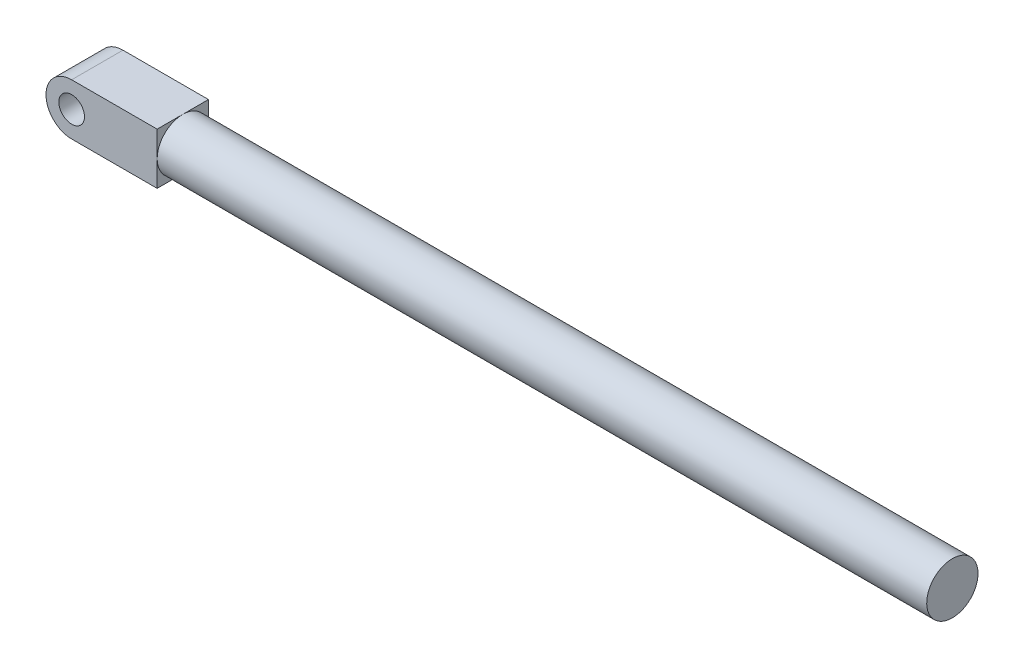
ISO-10303-21;
HEADER;
FILE_DESCRIPTION(('STEP AP214'),'2;1');
FILE_NAME('part.step','',(''),(''),'','','');
FILE_SCHEMA(('AUTOMOTIVE_DESIGN { 1 0 10303 214 1 1 1 1 }'));
ENDSEC;
DATA;
#1=APPLICATION_CONTEXT('core data for automotive mechanical design processes');
#2=APPLICATION_PROTOCOL_DEFINITION('international standard','automotive_design',2000,#1);
#3=PRODUCT_CONTEXT('',#1,'mechanical');
#4=PRODUCT('Part','Part','',(#3));
#5=PRODUCT_RELATED_PRODUCT_CATEGORY('part','',(#4));
#6=PRODUCT_DEFINITION_FORMATION('','',#4);
#7=PRODUCT_DEFINITION_CONTEXT('part definition',#1,'design');
#8=PRODUCT_DEFINITION('design','',#6,#7);
#9=PRODUCT_DEFINITION_SHAPE('','',#8);
#10=(LENGTH_UNIT() NAMED_UNIT(*) SI_UNIT(.MILLI.,.METRE.));
#11=(NAMED_UNIT(*) PLANE_ANGLE_UNIT() SI_UNIT($,.RADIAN.));
#12=(NAMED_UNIT(*) SI_UNIT($,.STERADIAN.) SOLID_ANGLE_UNIT());
#13=UNCERTAINTY_MEASURE_WITH_UNIT(LENGTH_MEASURE(1.E-05),#10,'distance_accuracy_value','');
#14=(GEOMETRIC_REPRESENTATION_CONTEXT(3) GLOBAL_UNCERTAINTY_ASSIGNED_CONTEXT((#13)) GLOBAL_UNIT_ASSIGNED_CONTEXT((#10,
#11,#12)) REPRESENTATION_CONTEXT('',''));
#15=CARTESIAN_POINT('',(0.,0.,0.));
#16=DIRECTION('',(0.,0.,1.));
#17=DIRECTION('',(1.,0.,0.));
#18=AXIS2_PLACEMENT_3D('',#15,#16,#17);
#19=CARTESIAN_POINT('',(5.00000000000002,1.5,3.));
#20=DIRECTION('',(-1.,0.,0.));
#21=DIRECTION('',(0.,-1.,0.));
#22=AXIS2_PLACEMENT_3D('',#19,#20,#21);
#23=PLANE('',#22);
#24=CARTESIAN_POINT('',(5.00000000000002,0.,1.5));
#25=DIRECTION('',(1.,0.,0.));
#26=DIRECTION('',(0.,1.,0.));
#27=AXIS2_PLACEMENT_3D('',#24,#25,#26);
#28=CIRCLE('',#27,1.5);
#29=CARTESIAN_POINT('',(5.00000000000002,1.50000000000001,1.5));
#30=VERTEX_POINT('',#29);
#31=CARTESIAN_POINT('',(5.00000000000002,0.,3.));
#32=VERTEX_POINT('',#31);
#33=EDGE_CURVE('E42',#30,#32,#28,.T.);
#34=ORIENTED_EDGE('',*,*,#33,.F.);
#35=DIRECTION('',(0.,0.,-1.));
#36=VECTOR('',#35,1.);
#37=CARTESIAN_POINT('',(5.00000000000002,1.5,3.));
#38=LINE('',#37,#36);
#39=CARTESIAN_POINT('',(5.00000000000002,1.5,3.));
#40=VERTEX_POINT('',#39);
#41=EDGE_CURVE('E87',#40,#30,#38,.T.);
#42=ORIENTED_EDGE('',*,*,#41,.F.);
#43=DIRECTION('',(0.,1.,0.));
#44=VECTOR('',#43,1.);
#45=CARTESIAN_POINT('',(5.00000000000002,1.5,3.));
#46=LINE('',#45,#44);
#47=EDGE_CURVE('E107',#32,#40,#46,.T.);
#48=ORIENTED_EDGE('',*,*,#47,.F.);
#49=EDGE_LOOP('',(#34,#42,#48));
#50=FACE_BOUND('',#49,.T.);
#51=ADVANCED_FACE('F31',(#50),#23,.F.);
#52=CARTESIAN_POINT('',(5.00000000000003,-1.5,1.5));
#53=VERTEX_POINT('',#52);
#54=EDGE_CURVE('E11',#32,#53,#28,.T.);
#55=ORIENTED_EDGE('',*,*,#54,.F.);
#56=CARTESIAN_POINT('',(5.00000000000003,-1.5,3.));
#57=VERTEX_POINT('',#56);
#58=EDGE_CURVE('E138',#57,#32,#46,.T.);
#59=ORIENTED_EDGE('',*,*,#58,.F.);
#60=DIRECTION('',(0.,0.,-1.));
#61=VECTOR('',#60,1.);
#62=CARTESIAN_POINT('',(5.00000000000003,-1.5,3.));
#63=LINE('',#62,#61);
#64=EDGE_CURVE('E113',#57,#53,#63,.T.);
#65=ORIENTED_EDGE('',*,*,#64,.T.);
#66=EDGE_LOOP('',(#55,#59,#65));
#67=FACE_BOUND('',#66,.T.);
#68=ADVANCED_FACE('F157',(#67),#23,.F.);
#69=CARTESIAN_POINT('',(5.00000000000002,0.,0.));
#70=VERTEX_POINT('',#69);
#71=EDGE_CURVE('E40',#53,#70,#28,.T.);
#72=ORIENTED_EDGE('',*,*,#71,.F.);
#73=CARTESIAN_POINT('',(5.00000000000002,-1.5,0.));
#74=VERTEX_POINT('',#73);
#75=EDGE_CURVE('E96',#53,#74,#63,.T.);
#76=ORIENTED_EDGE('',*,*,#75,.T.);
#77=DIRECTION('',(0.,1.,0.));
#78=VECTOR('',#77,1.);
#79=CARTESIAN_POINT('',(5.00000000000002,1.5,0.));
#80=LINE('',#79,#78);
#81=EDGE_CURVE('E129',#74,#70,#80,.T.);
#82=ORIENTED_EDGE('',*,*,#81,.T.);
#83=EDGE_LOOP('',(#72,#76,#82));
#84=FACE_BOUND('',#83,.T.);
#85=ADVANCED_FACE('F143',(#84),#23,.F.);
#86=EDGE_CURVE('E101',#70,#30,#28,.T.);
#87=ORIENTED_EDGE('',*,*,#86,.F.);
#88=CARTESIAN_POINT('',(5.00000000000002,1.5,0.));
#89=VERTEX_POINT('',#88);
#90=EDGE_CURVE('E103',#70,#89,#80,.T.);
#91=ORIENTED_EDGE('',*,*,#90,.T.);
#92=EDGE_CURVE('E90',#30,#89,#38,.T.);
#93=ORIENTED_EDGE('',*,*,#92,.F.);
#94=EDGE_LOOP('',(#87,#91,#93));
#95=FACE_BOUND('',#94,.T.);
#96=ADVANCED_FACE('F99',(#95),#23,.F.);
#97=CARTESIAN_POINT('',(0.,0.,3.));
#98=DIRECTION('',(0.,0.,1.));
#99=DIRECTION('',(1.,0.,0.));
#100=AXIS2_PLACEMENT_3D('',#97,#98,#99);
#101=PLANE('',#100);
#102=CARTESIAN_POINT('',(0.,0.,3.));
#103=DIRECTION('',(0.,0.,1.));
#104=DIRECTION('',(1.,0.,0.));
#105=AXIS2_PLACEMENT_3D('',#102,#103,#104);
#106=CIRCLE('',#105,1.5);
#107=CARTESIAN_POINT('',(0.,1.5,3.));
#108=VERTEX_POINT('',#107);
#109=CARTESIAN_POINT('',(0.,-1.5,3.));
#110=VERTEX_POINT('',#109);
#111=EDGE_CURVE('E133',#108,#110,#106,.T.);
#112=ORIENTED_EDGE('',*,*,#111,.T.);
#113=DIRECTION('',(1.,0.,0.));
#114=VECTOR('',#113,1.);
#115=CARTESIAN_POINT('',(0.,-1.5,3.));
#116=LINE('',#115,#114);
#117=EDGE_CURVE('E136',#110,#57,#116,.T.);
#118=ORIENTED_EDGE('',*,*,#117,.T.);
#119=ORIENTED_EDGE('',*,*,#58,.T.);
#120=ORIENTED_EDGE('',*,*,#47,.T.);
#121=DIRECTION('',(-1.,0.,0.));
#122=VECTOR('',#121,1.);
#123=CARTESIAN_POINT('',(0.,1.5,3.));
#124=LINE('',#123,#122);
#125=EDGE_CURVE('E93',#40,#108,#124,.T.);
#126=ORIENTED_EDGE('',*,*,#125,.T.);
#127=EDGE_LOOP('',(#112,#118,#119,#120,#126));
#128=FACE_BOUND('',#127,.T.);
#129=CARTESIAN_POINT('',(0.,0.,3.));
#130=DIRECTION('',(0.,0.,1.));
#131=DIRECTION('',(1.,0.,0.));
#132=AXIS2_PLACEMENT_3D('',#129,#130,#131);
#133=CIRCLE('',#132,0.75);
#134=CARTESIAN_POINT('',(0.75,0.,3.));
#135=VERTEX_POINT('',#134);
#136=EDGE_CURVE('E120',#135,#135,#133,.T.);
#137=ORIENTED_EDGE('',*,*,#136,.F.);
#138=EDGE_LOOP('',(#137));
#139=FACE_BOUND('',#138,.T.);
#140=ADVANCED_FACE('F155',(#128,#139),#101,.T.);
#141=CARTESIAN_POINT('',(0.,0.,0.));
#142=DIRECTION('',(0.,0.,1.));
#143=DIRECTION('',(1.,0.,0.));
#144=AXIS2_PLACEMENT_3D('',#141,#142,#143);
#145=PLANE('',#144);
#146=CARTESIAN_POINT('',(0.,0.,0.));
#147=DIRECTION('',(0.,0.,1.));
#148=DIRECTION('',(1.,0.,0.));
#149=AXIS2_PLACEMENT_3D('',#146,#147,#148);
#150=CIRCLE('',#149,1.5);
#151=CARTESIAN_POINT('',(0.,1.5,0.));
#152=VERTEX_POINT('',#151);
#153=CARTESIAN_POINT('',(0.,-1.5,0.));
#154=VERTEX_POINT('',#153);
#155=EDGE_CURVE('E123',#152,#154,#150,.T.);
#156=ORIENTED_EDGE('',*,*,#155,.F.);
#157=DIRECTION('',(-1.,0.,0.));
#158=VECTOR('',#157,1.);
#159=CARTESIAN_POINT('',(0.,1.5,0.));
#160=LINE('',#159,#158);
#161=EDGE_CURVE('E131',#89,#152,#160,.T.);
#162=ORIENTED_EDGE('',*,*,#161,.F.);
#163=ORIENTED_EDGE('',*,*,#90,.F.);
#164=ORIENTED_EDGE('',*,*,#81,.F.);
#165=DIRECTION('',(1.,0.,0.));
#166=VECTOR('',#165,1.);
#167=CARTESIAN_POINT('',(0.,-1.5,0.));
#168=LINE('',#167,#166);
#169=EDGE_CURVE('E126',#154,#74,#168,.T.);
#170=ORIENTED_EDGE('',*,*,#169,.F.);
#171=EDGE_LOOP('',(#156,#162,#163,#164,#170));
#172=FACE_BOUND('',#171,.T.);
#173=CARTESIAN_POINT('',(0.,0.,0.));
#174=DIRECTION('',(0.,0.,1.));
#175=DIRECTION('',(1.,0.,0.));
#176=AXIS2_PLACEMENT_3D('',#173,#174,#175);
#177=CIRCLE('',#176,0.75);
#178=CARTESIAN_POINT('',(0.75,0.,0.));
#179=VERTEX_POINT('',#178);
#180=EDGE_CURVE('E117',#179,#179,#177,.T.);
#181=ORIENTED_EDGE('',*,*,#180,.T.);
#182=EDGE_LOOP('',(#181));
#183=FACE_BOUND('',#182,.T.);
#184=ADVANCED_FACE('F150',(#172,#183),#145,.F.);
#185=CARTESIAN_POINT('',(0.,0.,3.));
#186=DIRECTION('',(0.,0.,-1.));
#187=DIRECTION('',(-1.,0.,0.));
#188=AXIS2_PLACEMENT_3D('',#185,#186,#187);
#189=CYLINDRICAL_SURFACE('',#188,1.5);
#190=ORIENTED_EDGE('',*,*,#155,.T.);
#191=DIRECTION('',(0.,0.,-1.));
#192=VECTOR('',#191,1.);
#193=CARTESIAN_POINT('',(0.,-1.5,3.));
#194=LINE('',#193,#192);
#195=EDGE_CURVE('E35',#110,#154,#194,.T.);
#196=ORIENTED_EDGE('',*,*,#195,.F.);
#197=ORIENTED_EDGE('',*,*,#111,.F.);
#198=DIRECTION('',(0.,0.,-1.));
#199=VECTOR('',#198,1.);
#200=CARTESIAN_POINT('',(0.,1.5,3.));
#201=LINE('',#200,#199);
#202=EDGE_CURVE('E105',#108,#152,#201,.T.);
#203=ORIENTED_EDGE('',*,*,#202,.T.);
#204=EDGE_LOOP('',(#190,#196,#197,#203));
#205=FACE_BOUND('',#204,.T.);
#206=ADVANCED_FACE('F33',(#205),#189,.T.);
#207=CARTESIAN_POINT('',(0.,-1.5,3.));
#208=DIRECTION('',(0.,1.,0.));
#209=DIRECTION('',(0.,0.,1.));
#210=AXIS2_PLACEMENT_3D('',#207,#208,#209);
#211=PLANE('',#210);
#212=ORIENTED_EDGE('',*,*,#169,.T.);
#213=ORIENTED_EDGE('',*,*,#75,.F.);
#214=ORIENTED_EDGE('',*,*,#64,.F.);
#215=ORIENTED_EDGE('',*,*,#117,.F.);
#216=ORIENTED_EDGE('',*,*,#195,.T.);
#217=EDGE_LOOP('',(#212,#213,#214,#215,#216));
#218=FACE_BOUND('',#217,.T.);
#219=ADVANCED_FACE('F146',(#218),#211,.F.);
#220=CARTESIAN_POINT('',(0.,1.5,3.));
#221=DIRECTION('',(0.,-1.,0.));
#222=DIRECTION('',(0.,0.,-1.));
#223=AXIS2_PLACEMENT_3D('',#220,#221,#222);
#224=PLANE('',#223);
#225=ORIENTED_EDGE('',*,*,#161,.T.);
#226=ORIENTED_EDGE('',*,*,#202,.F.);
#227=ORIENTED_EDGE('',*,*,#125,.F.);
#228=ORIENTED_EDGE('',*,*,#41,.T.);
#229=ORIENTED_EDGE('',*,*,#92,.T.);
#230=EDGE_LOOP('',(#225,#226,#227,#228,#229));
#231=FACE_BOUND('',#230,.T.);
#232=ADVANCED_FACE('F89',(#231),#224,.F.);
#233=CARTESIAN_POINT('',(0.,0.,3.));
#234=DIRECTION('',(0.,0.,-1.));
#235=DIRECTION('',(-1.,0.,0.));
#236=AXIS2_PLACEMENT_3D('',#233,#234,#235);
#237=CYLINDRICAL_SURFACE('',#236,0.75);
#238=ORIENTED_EDGE('',*,*,#136,.T.);
#239=EDGE_LOOP('',(#238));
#240=FACE_BOUND('',#239,.T.);
#241=ORIENTED_EDGE('',*,*,#180,.F.);
#242=EDGE_LOOP('',(#241));
#243=FACE_BOUND('',#242,.T.);
#244=ADVANCED_FACE('F171',(#240,#243),#237,.F.);
#245=CARTESIAN_POINT('',(50.,0.,1.5));
#246=DIRECTION('',(-1.,0.,0.));
#247=DIRECTION('',(0.,-1.,0.));
#248=AXIS2_PLACEMENT_3D('',#245,#246,#247);
#249=CYLINDRICAL_SURFACE('',#248,1.5);
#250=CARTESIAN_POINT('',(50.,0.,1.5));
#251=DIRECTION('',(1.,0.,0.));
#252=DIRECTION('',(0.,1.,0.));
#253=AXIS2_PLACEMENT_3D('',#250,#251,#252);
#254=CIRCLE('',#253,1.5);
#255=CARTESIAN_POINT('',(50.,1.50000000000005,1.5));
#256=VERTEX_POINT('',#255);
#257=EDGE_CURVE('E110',#256,#256,#254,.T.);
#258=ORIENTED_EDGE('',*,*,#257,.F.);
#259=EDGE_LOOP('',(#258));
#260=FACE_BOUND('',#259,.T.);
#261=ORIENTED_EDGE('',*,*,#33,.T.);
#262=ORIENTED_EDGE('',*,*,#54,.T.);
#263=ORIENTED_EDGE('',*,*,#71,.T.);
#264=ORIENTED_EDGE('',*,*,#86,.T.);
#265=EDGE_LOOP('',(#261,#262,#263,#264));
#266=FACE_BOUND('',#265,.T.);
#267=ADVANCED_FACE('F111',(#260,#266),#249,.T.);
#268=CARTESIAN_POINT('',(50.,0.,1.5));
#269=DIRECTION('',(1.,0.,0.));
#270=DIRECTION('',(0.,1.,0.));
#271=AXIS2_PLACEMENT_3D('',#268,#269,#270);
#272=PLANE('',#271);
#273=ORIENTED_EDGE('',*,*,#257,.T.);
#274=EDGE_LOOP('',(#273));
#275=FACE_BOUND('',#274,.T.);
#276=ADVANCED_FACE('F185',(#275),#272,.T.);
#277=CLOSED_SHELL('',(#51,#68,#85,#96,#140,#184,#206,#219,#232,#244,#267,#276));
#278=MANIFOLD_SOLID_BREP('B2',#277);
#279=ADVANCED_BREP_SHAPE_REPRESENTATION('',(#18,#278),#14);
#280=SHAPE_DEFINITION_REPRESENTATION(#9,#279);
ENDSEC;
END-ISO-10303-21;
